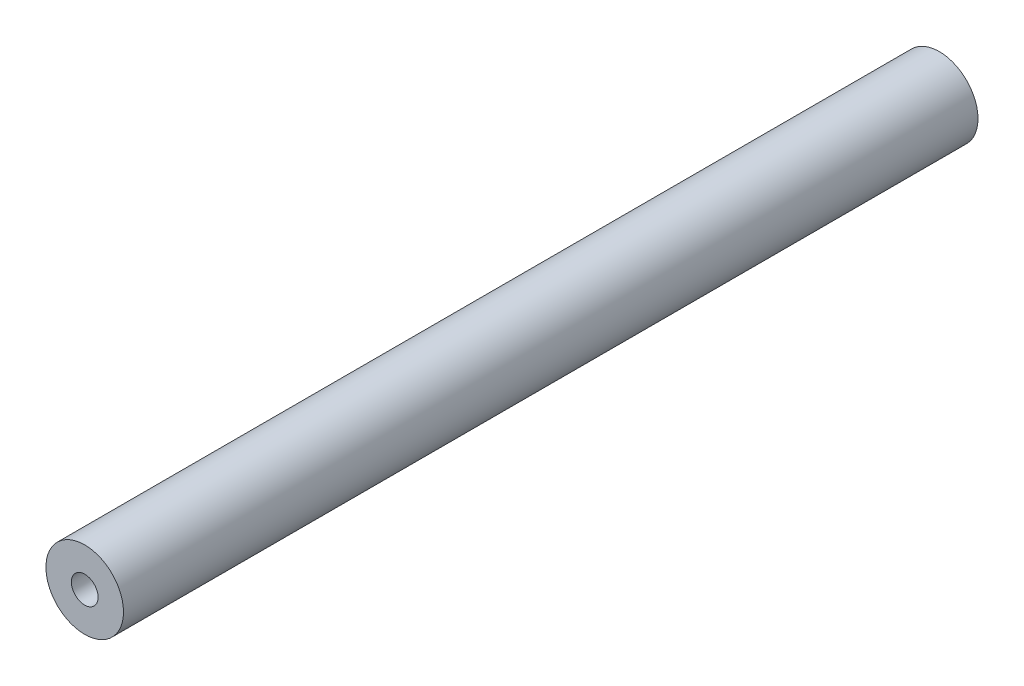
ISO-10303-21;
HEADER;
FILE_DESCRIPTION(('STEP AP214'),'2;1');
FILE_NAME('part.step','',(''),(''),'','','');
FILE_SCHEMA(('AUTOMOTIVE_DESIGN { 1 0 10303 214 1 1 1 1 }'));
ENDSEC;
DATA;
#1=APPLICATION_CONTEXT('core data for automotive mechanical design processes');
#2=APPLICATION_PROTOCOL_DEFINITION('international standard','automotive_design',2000,#1);
#3=PRODUCT_CONTEXT('',#1,'mechanical');
#4=PRODUCT('Part','Part','',(#3));
#5=PRODUCT_RELATED_PRODUCT_CATEGORY('part','',(#4));
#6=PRODUCT_DEFINITION_FORMATION('','',#4);
#7=PRODUCT_DEFINITION_CONTEXT('part definition',#1,'design');
#8=PRODUCT_DEFINITION('design','',#6,#7);
#9=PRODUCT_DEFINITION_SHAPE('','',#8);
#10=(LENGTH_UNIT() NAMED_UNIT(*) SI_UNIT(.MILLI.,.METRE.));
#11=(NAMED_UNIT(*) PLANE_ANGLE_UNIT() SI_UNIT($,.RADIAN.));
#12=(NAMED_UNIT(*) SI_UNIT($,.STERADIAN.) SOLID_ANGLE_UNIT());
#13=UNCERTAINTY_MEASURE_WITH_UNIT(LENGTH_MEASURE(1.E-05),#10,'distance_accuracy_value','');
#14=(GEOMETRIC_REPRESENTATION_CONTEXT(3) GLOBAL_UNCERTAINTY_ASSIGNED_CONTEXT((#13)) GLOBAL_UNIT_ASSIGNED_CONTEXT((#10,
#11,#12)) REPRESENTATION_CONTEXT('',''));
#15=CARTESIAN_POINT('',(0.,0.,0.));
#16=DIRECTION('',(0.,0.,1.));
#17=DIRECTION('',(1.,0.,0.));
#18=AXIS2_PLACEMENT_3D('',#15,#16,#17);
#19=CARTESIAN_POINT('',(0.,0.,106.8));
#20=DIRECTION('',(0.,0.,1.));
#21=DIRECTION('',(1.,0.,0.));
#22=AXIS2_PLACEMENT_3D('',#19,#20,#21);
#23=CONICAL_SURFACE('',#22,2.07010000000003,1.02974425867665);
#24=CARTESIAN_POINT('',(0.,0.,105.556158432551));
#25=VERTEX_POINT('',#24);
#26=VERTEX_LOOP('',#25);
#27=FACE_BOUND('',#26,.T.);
#28=CARTESIAN_POINT('',(0.,0.,106.8));
#29=DIRECTION('',(0.,0.,1.));
#30=DIRECTION('',(1.,0.,0.));
#31=AXIS2_PLACEMENT_3D('',#28,#29,#30);
#32=CIRCLE('',#31,2.0701);
#33=CARTESIAN_POINT('',(2.0701,0.,106.8));
#34=VERTEX_POINT('',#33);
#35=EDGE_CURVE('E32',#34,#34,#32,.T.);
#36=ORIENTED_EDGE('',*,*,#35,.T.);
#37=EDGE_LOOP('',(#36));
#38=FACE_BOUND('',#37,.T.);
#39=ADVANCED_FACE('F16',(#27,#38),#23,.F.);
#40=CARTESIAN_POINT('',(0.,0.,132.2));
#41=DIRECTION('',(0.,0.,-1.));
#42=DIRECTION('',(0.,1.,0.));
#43=AXIS2_PLACEMENT_3D('',#40,#41,#42);
#44=CYLINDRICAL_SURFACE('',#43,2.0701);
#45=ORIENTED_EDGE('',*,*,#35,.F.);
#46=EDGE_LOOP('',(#45));
#47=FACE_BOUND('',#46,.T.);
#48=CARTESIAN_POINT('',(0.,0.,132.2));
#49=DIRECTION('',(0.,0.,-1.));
#50=DIRECTION('',(0.,1.,0.));
#51=AXIS2_PLACEMENT_3D('',#48,#49,#50);
#52=CIRCLE('',#51,2.0701);
#53=CARTESIAN_POINT('',(0.,2.0701,132.2));
#54=VERTEX_POINT('',#53);
#55=EDGE_CURVE('E20',#54,#54,#52,.F.);
#56=ORIENTED_EDGE('',*,*,#55,.T.);
#57=EDGE_LOOP('',(#56));
#58=FACE_BOUND('',#57,.T.);
#59=ADVANCED_FACE('F18',(#47,#58),#44,.F.);
#60=CARTESIAN_POINT('',(0.,0.,132.2));
#61=DIRECTION('',(0.,0.,-1.));
#62=DIRECTION('',(-1.,0.,0.));
#63=AXIS2_PLACEMENT_3D('',#60,#61,#62);
#64=PLANE('',#63);
#65=ORIENTED_EDGE('',*,*,#55,.F.);
#66=EDGE_LOOP('',(#65));
#67=FACE_BOUND('',#66,.T.);
#68=CARTESIAN_POINT('',(0.,0.,132.2));
#69=DIRECTION('',(0.,0.,1.));
#70=DIRECTION('',(1.,0.,0.));
#71=AXIS2_PLACEMENT_3D('',#68,#69,#70);
#72=CIRCLE('',#71,6.);
#73=CARTESIAN_POINT('',(6.,0.,132.2));
#74=VERTEX_POINT('',#73);
#75=EDGE_CURVE('E24',#74,#74,#72,.F.);
#76=ORIENTED_EDGE('',*,*,#75,.F.);
#77=EDGE_LOOP('',(#76));
#78=FACE_BOUND('',#77,.T.);
#79=ADVANCED_FACE('F43',(#67,#78),#64,.F.);
#80=CARTESIAN_POINT('',(0.,0.,0.));
#81=DIRECTION('',(0.,0.,-1.));
#82=DIRECTION('',(-1.,0.,0.));
#83=AXIS2_PLACEMENT_3D('',#80,#81,#82);
#84=PLANE('',#83);
#85=CARTESIAN_POINT('',(0.,0.,0.));
#86=DIRECTION('',(0.,0.,1.));
#87=DIRECTION('',(1.,0.,0.));
#88=AXIS2_PLACEMENT_3D('',#85,#86,#87);
#89=CIRCLE('',#88,6.);
#90=CARTESIAN_POINT('',(6.,0.,0.));
#91=VERTEX_POINT('',#90);
#92=EDGE_CURVE('E10',#91,#91,#89,.T.);
#93=ORIENTED_EDGE('',*,*,#92,.F.);
#94=EDGE_LOOP('',(#93));
#95=FACE_BOUND('',#94,.T.);
#96=ADVANCED_FACE('F45',(#95),#84,.T.);
#97=CARTESIAN_POINT('',(0.,0.,0.));
#98=DIRECTION('',(0.,0.,1.));
#99=DIRECTION('',(1.,0.,0.));
#100=AXIS2_PLACEMENT_3D('',#97,#98,#99);
#101=CYLINDRICAL_SURFACE('',#100,6.);
#102=ORIENTED_EDGE('',*,*,#92,.T.);
#103=EDGE_LOOP('',(#102));
#104=FACE_BOUND('',#103,.T.);
#105=ORIENTED_EDGE('',*,*,#75,.T.);
#106=EDGE_LOOP('',(#105));
#107=FACE_BOUND('',#106,.T.);
#108=ADVANCED_FACE('F41',(#104,#107),#101,.T.);
#109=CLOSED_SHELL('',(#39,#59,#79,#96,#108));
#110=MANIFOLD_SOLID_BREP('B1',#109);
#111=ADVANCED_BREP_SHAPE_REPRESENTATION('',(#18,#110),#14);
#112=SHAPE_DEFINITION_REPRESENTATION(#9,#111);
ENDSEC;
END-ISO-10303-21;
